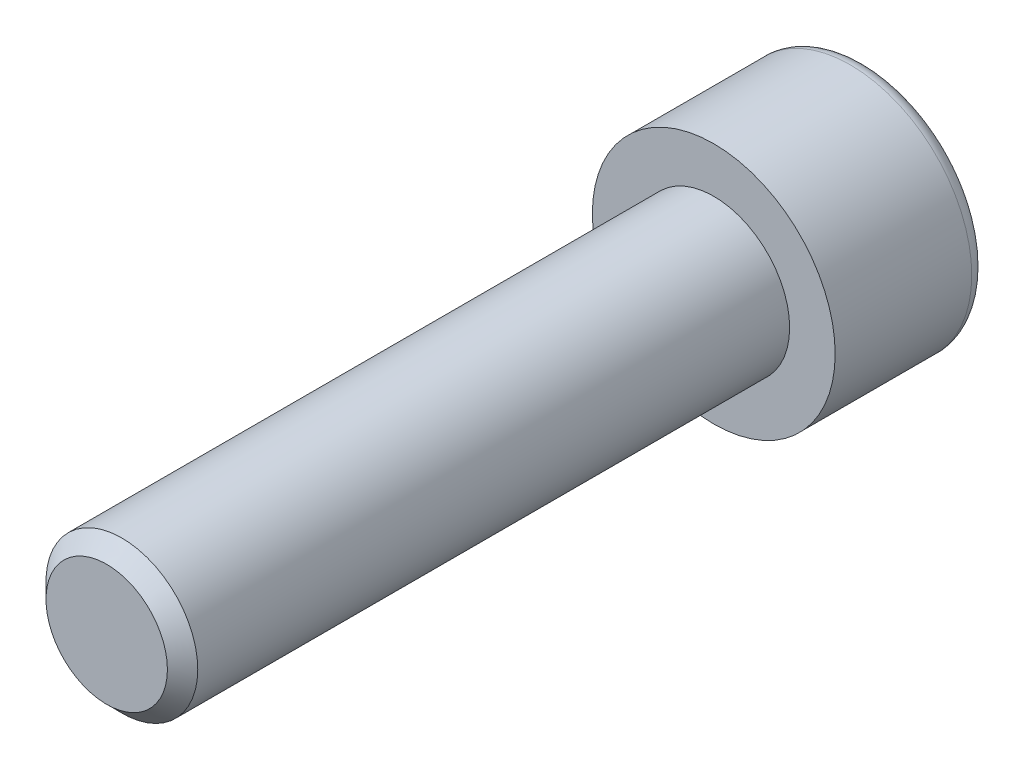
from build123d import *

# Parameters (mm, degrees)
ENLEV_MAT_EXTRU1_DEPTH = 5
ESQUISSE3_W            = 5
ESQUISSE3_H            = 40
CHANFREIN1_SIZE        = 1


with BuildPart() as part:
    # Esquisse1 → Base-R_volution (revolve)
    with BuildSketch(Plane(origin=(0, 0, 0), x_dir=(1, 0, 0), z_dir=(0, 1, 0)), mode=Mode.PRIVATE) as base_r_volution_sk:
        with BuildLine():
            Line((0, 0), (8, 0))
            Line((8, 0), (8, 9))
            ThreePointArc((8, 9), (7.707106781, 9.707106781), (7, 10))
            Line((7, 10), (0, 10))
            Line((0, 10), (0, 0))
        make_face()
    revolve(base_r_volution_sk.sketch.rotate(Axis((0, 0, 0), (0, 0, -1)), 180), axis=Axis((0, 0, 0), (0, 0, -1)))

    # Esquisse2 → enlev-mat-Extru1 (cut)
    with BuildSketch(Plane.XY.offset(-10)):
        Polygon((4, -2.309401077), (4, 2.309401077), (0, 4.618802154), (-4, 2.309401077), (-4, -2.309401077), (0, -4.618802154), align=None)
    extrude(amount=ENLEV_MAT_EXTRU1_DEPTH, mode=Mode.SUBTRACT)

    # Esquisse3 → Boss.-R_vol.1 (revolve)
    with BuildSketch(Plane(origin=(0, 0, 0), x_dir=(1, 0, 0), z_dir=(0, 1, 0))):
        with Locations((2.5, -20)):
            Rectangle(ESQUISSE3_W, ESQUISSE3_H)
    revolve(axis=Axis((0, 0, 0), (0, 0, 1)))

    # Chanfrein1
    chanfrein1_edges = [part.edges().sort_by_distance(p)[0] for p in [
        (-5, 0, 40),
    ]]
    chamfer(chanfrein1_edges, length=CHANFREIN1_SIZE)


solid = part.part
